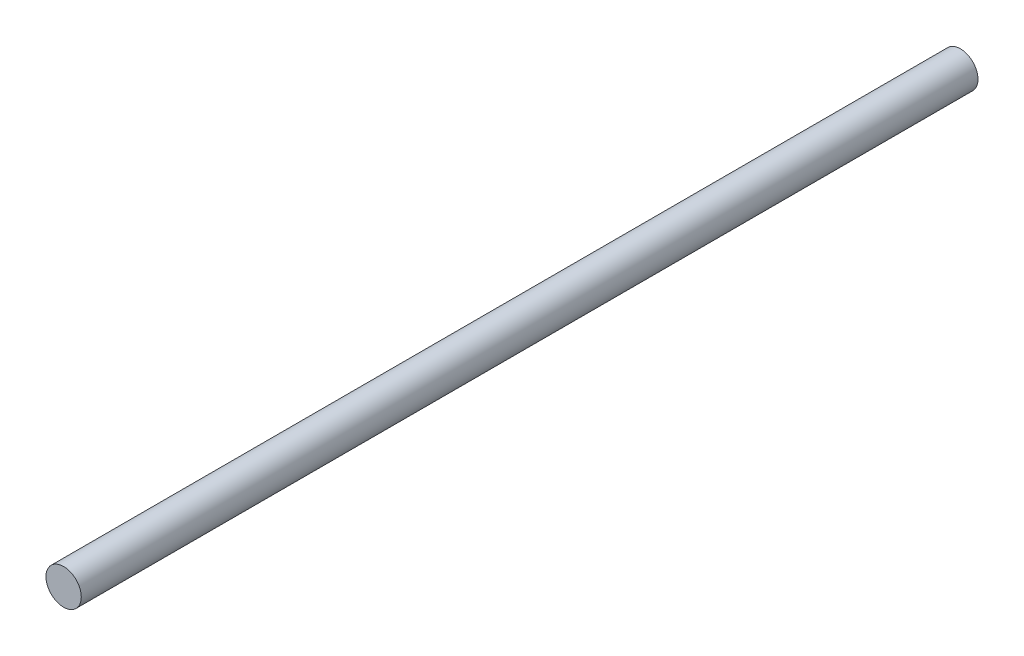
ISO-10303-21;
HEADER;
FILE_DESCRIPTION(('STEP AP214'),'2;1');
FILE_NAME('part.step','',(''),(''),'','','');
FILE_SCHEMA(('AUTOMOTIVE_DESIGN { 1 0 10303 214 1 1 1 1 }'));
ENDSEC;
DATA;
#1=APPLICATION_CONTEXT('core data for automotive mechanical design processes');
#2=APPLICATION_PROTOCOL_DEFINITION('international standard','automotive_design',2000,#1);
#3=PRODUCT_CONTEXT('',#1,'mechanical');
#4=PRODUCT('Part','Part','',(#3));
#5=PRODUCT_RELATED_PRODUCT_CATEGORY('part','',(#4));
#6=PRODUCT_DEFINITION_FORMATION('','',#4);
#7=PRODUCT_DEFINITION_CONTEXT('part definition',#1,'design');
#8=PRODUCT_DEFINITION('design','',#6,#7);
#9=PRODUCT_DEFINITION_SHAPE('','',#8);
#10=(LENGTH_UNIT() NAMED_UNIT(*) SI_UNIT(.MILLI.,.METRE.));
#11=(NAMED_UNIT(*) PLANE_ANGLE_UNIT() SI_UNIT($,.RADIAN.));
#12=(NAMED_UNIT(*) SI_UNIT($,.STERADIAN.) SOLID_ANGLE_UNIT());
#13=UNCERTAINTY_MEASURE_WITH_UNIT(LENGTH_MEASURE(1.E-05),#10,'distance_accuracy_value','');
#14=(GEOMETRIC_REPRESENTATION_CONTEXT(3) GLOBAL_UNCERTAINTY_ASSIGNED_CONTEXT((#13)) GLOBAL_UNIT_ASSIGNED_CONTEXT((#10,
#11,#12)) REPRESENTATION_CONTEXT('',''));
#15=CARTESIAN_POINT('',(0.,0.,0.));
#16=DIRECTION('',(0.,0.,1.));
#17=DIRECTION('',(1.,0.,0.));
#18=AXIS2_PLACEMENT_3D('',#15,#16,#17);
#19=CARTESIAN_POINT('',(0.,0.,254.));
#20=DIRECTION('',(0.,0.,-1.));
#21=DIRECTION('',(-1.,0.,0.));
#22=AXIS2_PLACEMENT_3D('',#19,#20,#21);
#23=CYLINDRICAL_SURFACE('',#22,5.);
#24=CARTESIAN_POINT('',(0.,0.,254.));
#25=DIRECTION('',(0.,0.,1.));
#26=DIRECTION('',(1.,0.,0.));
#27=AXIS2_PLACEMENT_3D('',#24,#25,#26);
#28=CIRCLE('',#27,5.);
#29=CARTESIAN_POINT('',(5.,0.,254.));
#30=VERTEX_POINT('',#29);
#31=EDGE_CURVE('E10',#30,#30,#28,.T.);
#32=ORIENTED_EDGE('',*,*,#31,.F.);
#33=EDGE_LOOP('',(#32));
#34=FACE_BOUND('',#33,.T.);
#35=CARTESIAN_POINT('',(0.,0.,0.));
#36=DIRECTION('',(0.,0.,1.));
#37=DIRECTION('',(1.,0.,0.));
#38=AXIS2_PLACEMENT_3D('',#35,#36,#37);
#39=CIRCLE('',#38,5.);
#40=CARTESIAN_POINT('',(5.,0.,0.));
#41=VERTEX_POINT('',#40);
#42=EDGE_CURVE('E34',#41,#41,#39,.T.);
#43=ORIENTED_EDGE('',*,*,#42,.T.);
#44=EDGE_LOOP('',(#43));
#45=FACE_BOUND('',#44,.T.);
#46=ADVANCED_FACE('F31',(#34,#45),#23,.T.);
#47=CARTESIAN_POINT('',(0.,0.,254.));
#48=DIRECTION('',(0.,0.,1.));
#49=DIRECTION('',(1.,0.,0.));
#50=AXIS2_PLACEMENT_3D('',#47,#48,#49);
#51=PLANE('',#50);
#52=ORIENTED_EDGE('',*,*,#31,.T.);
#53=EDGE_LOOP('',(#52));
#54=FACE_BOUND('',#53,.T.);
#55=ADVANCED_FACE('F46',(#54),#51,.T.);
#56=CARTESIAN_POINT('',(0.,0.,0.));
#57=DIRECTION('',(0.,0.,1.));
#58=DIRECTION('',(1.,0.,0.));
#59=AXIS2_PLACEMENT_3D('',#56,#57,#58);
#60=PLANE('',#59);
#61=ORIENTED_EDGE('',*,*,#42,.F.);
#62=EDGE_LOOP('',(#61));
#63=FACE_BOUND('',#62,.T.);
#64=ADVANCED_FACE('F44',(#63),#60,.F.);
#65=CLOSED_SHELL('',(#46,#55,#64));
#66=MANIFOLD_SOLID_BREP('B2',#65);
#67=ADVANCED_BREP_SHAPE_REPRESENTATION('',(#18,#66),#14);
#68=SHAPE_DEFINITION_REPRESENTATION(#9,#67);
ENDSEC;
END-ISO-10303-21;
